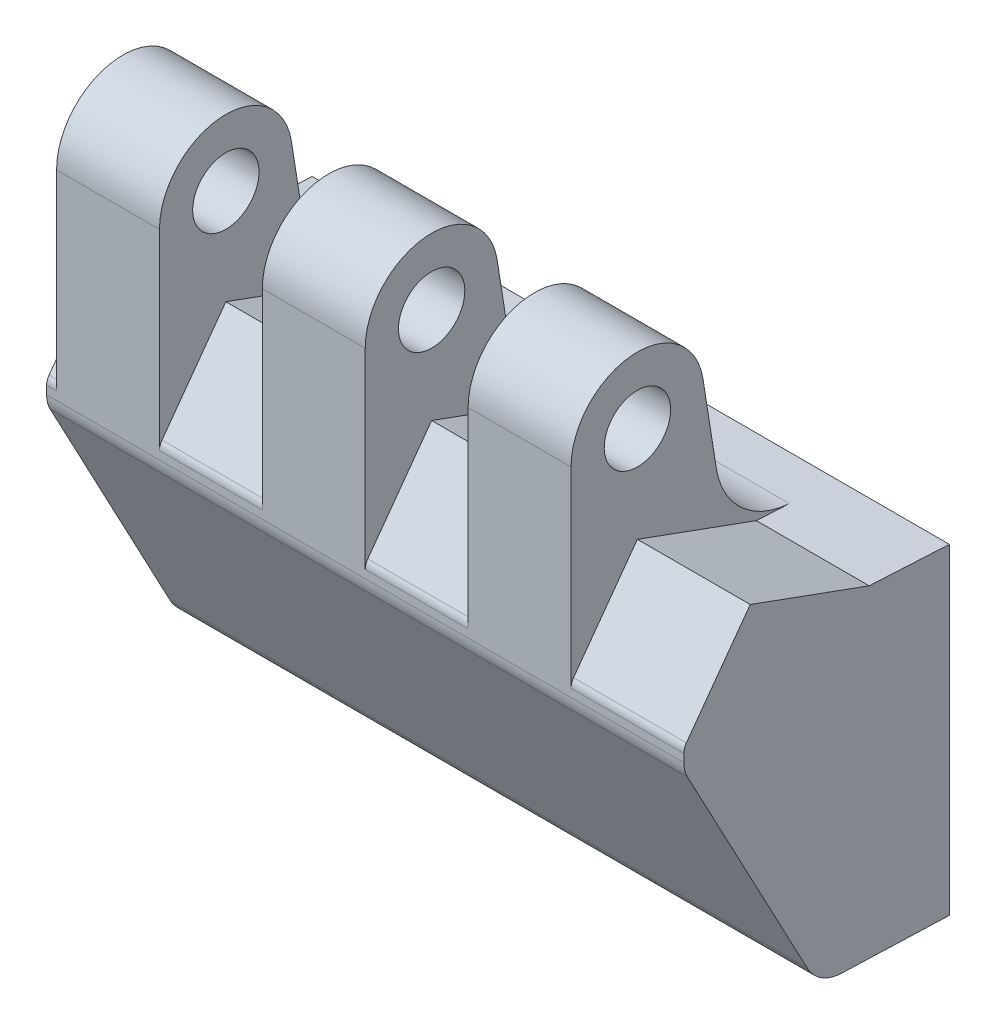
ISO-10303-21;
HEADER;
FILE_DESCRIPTION(('STEP AP214'),'2;1');
FILE_NAME('part.step','',(''),(''),'','','');
FILE_SCHEMA(('AUTOMOTIVE_DESIGN { 1 0 10303 214 1 1 1 1 }'));
ENDSEC;
DATA;
#1=APPLICATION_CONTEXT('core data for automotive mechanical design processes');
#2=APPLICATION_PROTOCOL_DEFINITION('international standard','automotive_design',2000,#1);
#3=PRODUCT_CONTEXT('',#1,'mechanical');
#4=PRODUCT('Part','Part','',(#3));
#5=PRODUCT_RELATED_PRODUCT_CATEGORY('part','',(#4));
#6=PRODUCT_DEFINITION_FORMATION('','',#4);
#7=PRODUCT_DEFINITION_CONTEXT('part definition',#1,'design');
#8=PRODUCT_DEFINITION('design','',#6,#7);
#9=PRODUCT_DEFINITION_SHAPE('','',#8);
#10=(LENGTH_UNIT() NAMED_UNIT(*) SI_UNIT(.MILLI.,.METRE.));
#11=(NAMED_UNIT(*) PLANE_ANGLE_UNIT() SI_UNIT($,.RADIAN.));
#12=(NAMED_UNIT(*) SI_UNIT($,.STERADIAN.) SOLID_ANGLE_UNIT());
#13=UNCERTAINTY_MEASURE_WITH_UNIT(LENGTH_MEASURE(1.E-05),#10,'distance_accuracy_value','');
#14=(GEOMETRIC_REPRESENTATION_CONTEXT(3) GLOBAL_UNCERTAINTY_ASSIGNED_CONTEXT((#13)) GLOBAL_UNIT_ASSIGNED_CONTEXT((#10,
#11,#12)) REPRESENTATION_CONTEXT('',''));
#15=CARTESIAN_POINT('',(0.,0.,0.));
#16=DIRECTION('',(0.,0.,1.));
#17=DIRECTION('',(1.,0.,0.));
#18=AXIS2_PLACEMENT_3D('',#15,#16,#17);
#19=CARTESIAN_POINT('',(-12.25,8.5711707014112,20.));
#20=DIRECTION('',(0.,0.,1.));
#21=DIRECTION('',(-1.,0.,0.));
#22=AXIS2_PLACEMENT_3D('',#19,#20,#21);
#23=PLANE('',#22);
#24=DIRECTION('',(-1.,0.,0.));
#25=VECTOR('',#24,1.);
#26=CARTESIAN_POINT('',(-12.25,8.5711707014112,20.));
#27=LINE('',#26,#25);
#28=CARTESIAN_POINT('',(-12.,8.5711707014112,20.));
#29=VERTEX_POINT('',#28);
#30=CARTESIAN_POINT('',(-11.25,8.5711707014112,20.));
#31=VERTEX_POINT('',#30);
#32=EDGE_CURVE('E347',#29,#31,#27,.F.);
#33=ORIENTED_EDGE('',*,*,#32,.F.);
#34=DIRECTION('',(0.,1.,0.));
#35=VECTOR('',#34,1.);
#36=CARTESIAN_POINT('',(-12.,7.9570784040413,20.));
#37=LINE('',#36,#35);
#38=CARTESIAN_POINT('',(-12.,7.9570784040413,20.));
#39=VERTEX_POINT('',#38);
#40=EDGE_CURVE('E30',#39,#29,#37,.T.);
#41=ORIENTED_EDGE('',*,*,#40,.F.);
#42=DIRECTION('',(-1.,0.,0.));
#43=VECTOR('',#42,1.);
#44=CARTESIAN_POINT('',(-12.25,7.9570784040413,20.));
#45=LINE('',#44,#43);
#46=CARTESIAN_POINT('',(36.,7.9570784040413,20.));
#47=VERTEX_POINT('',#46);
#48=EDGE_CURVE('E303',#39,#47,#45,.F.);
#49=ORIENTED_EDGE('',*,*,#48,.T.);
#50=DIRECTION('',(0.,-1.,0.));
#51=VECTOR('',#50,1.);
#52=CARTESIAN_POINT('',(36.,8.5711707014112,20.));
#53=LINE('',#52,#51);
#54=CARTESIAN_POINT('',(36.,8.5711707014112,20.));
#55=VERTEX_POINT('',#54);
#56=EDGE_CURVE('E650',#55,#47,#53,.T.);
#57=ORIENTED_EDGE('',*,*,#56,.F.);
#58=DIRECTION('',(-1.,0.,0.));
#59=VECTOR('',#58,1.);
#60=CARTESIAN_POINT('',(-12.25,8.5711707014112,20.));
#61=LINE('',#60,#59);
#62=CARTESIAN_POINT('',(27.5,8.5711707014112,20.));
#63=VERTEX_POINT('',#62);
#64=EDGE_CURVE('E336',#63,#55,#61,.F.);
#65=ORIENTED_EDGE('',*,*,#64,.F.);
#66=DIRECTION('',(0.,1.,0.));
#67=VECTOR('',#66,1.);
#68=CARTESIAN_POINT('',(27.5,23.,20.));
#69=LINE('',#68,#67);
#70=CARTESIAN_POINT('',(27.5,23.,20.));
#71=VERTEX_POINT('',#70);
#72=EDGE_CURVE('E399',#71,#63,#69,.F.);
#73=ORIENTED_EDGE('',*,*,#72,.F.);
#74=DIRECTION('',(-1.,0.,0.));
#75=VECTOR('',#74,1.);
#76=CARTESIAN_POINT('',(-12.25,23.,20.));
#77=LINE('',#76,#75);
#78=CARTESIAN_POINT('',(19.75,23.,20.));
#79=VERTEX_POINT('',#78);
#80=EDGE_CURVE('E333',#79,#71,#77,.F.);
#81=ORIENTED_EDGE('',*,*,#80,.F.);
#82=DIRECTION('',(0.,1.,0.));
#83=VECTOR('',#82,1.);
#84=CARTESIAN_POINT('',(19.75,23.,20.));
#85=LINE('',#84,#83);
#86=CARTESIAN_POINT('',(19.75,8.5711707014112,20.));
#87=VERTEX_POINT('',#86);
#88=EDGE_CURVE('E390',#79,#87,#85,.F.);
#89=ORIENTED_EDGE('',*,*,#88,.T.);
#90=DIRECTION('',(-1.,0.,0.));
#91=VECTOR('',#90,1.);
#92=CARTESIAN_POINT('',(-12.25,8.5711707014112,20.));
#93=LINE('',#92,#91);
#94=CARTESIAN_POINT('',(12.,8.5711707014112,20.));
#95=VERTEX_POINT('',#94);
#96=EDGE_CURVE('E308',#95,#87,#93,.F.);
#97=ORIENTED_EDGE('',*,*,#96,.F.);
#98=DIRECTION('',(0.,1.,0.));
#99=VECTOR('',#98,1.);
#100=CARTESIAN_POINT('',(12.,23.,20.));
#101=LINE('',#100,#99);
#102=CARTESIAN_POINT('',(12.,23.,20.));
#103=VERTEX_POINT('',#102);
#104=EDGE_CURVE('E379',#103,#95,#101,.F.);
#105=ORIENTED_EDGE('',*,*,#104,.F.);
#106=DIRECTION('',(-1.,0.,0.));
#107=VECTOR('',#106,1.);
#108=CARTESIAN_POINT('',(-12.25,23.,20.));
#109=LINE('',#108,#107);
#110=CARTESIAN_POINT('',(4.25,23.,20.));
#111=VERTEX_POINT('',#110);
#112=EDGE_CURVE('E305',#111,#103,#109,.F.);
#113=ORIENTED_EDGE('',*,*,#112,.F.);
#114=DIRECTION('',(0.,1.,0.));
#115=VECTOR('',#114,1.);
#116=CARTESIAN_POINT('',(4.25,23.,20.));
#117=LINE('',#116,#115);
#118=CARTESIAN_POINT('',(4.25,8.5711707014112,20.));
#119=VERTEX_POINT('',#118);
#120=EDGE_CURVE('E370',#111,#119,#117,.F.);
#121=ORIENTED_EDGE('',*,*,#120,.T.);
#122=DIRECTION('',(-1.,0.,0.));
#123=VECTOR('',#122,1.);
#124=CARTESIAN_POINT('',(-12.25,8.5711707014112,20.));
#125=LINE('',#124,#123);
#126=CARTESIAN_POINT('',(-3.5,8.5711707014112,20.));
#127=VERTEX_POINT('',#126);
#128=EDGE_CURVE('E309',#127,#119,#125,.F.);
#129=ORIENTED_EDGE('',*,*,#128,.F.);
#130=DIRECTION('',(0.,1.,0.));
#131=VECTOR('',#130,1.);
#132=CARTESIAN_POINT('',(-3.5,23.,20.));
#133=LINE('',#132,#131);
#134=CARTESIAN_POINT('',(-3.5,23.,20.));
#135=VERTEX_POINT('',#134);
#136=EDGE_CURVE('E417',#135,#127,#133,.F.);
#137=ORIENTED_EDGE('',*,*,#136,.F.);
#138=DIRECTION('',(-1.,0.,0.));
#139=VECTOR('',#138,1.);
#140=CARTESIAN_POINT('',(-12.25,23.,20.));
#141=LINE('',#140,#139);
#142=CARTESIAN_POINT('',(-11.25,23.,20.));
#143=VERTEX_POINT('',#142);
#144=EDGE_CURVE('E304',#143,#135,#141,.F.);
#145=ORIENTED_EDGE('',*,*,#144,.F.);
#146=DIRECTION('',(0.,1.,0.));
#147=VECTOR('',#146,1.);
#148=CARTESIAN_POINT('',(-11.25,23.,20.));
#149=LINE('',#148,#147);
#150=EDGE_CURVE('E405',#143,#31,#149,.F.);
#151=ORIENTED_EDGE('',*,*,#150,.T.);
#152=EDGE_LOOP('',(#33,#41,#49,#57,#65,#73,#81,#89,#97,#105,#113,#121,#129,#137,#145,#151));
#153=FACE_BOUND('',#152,.T.);
#154=ADVANCED_FACE('F14',(#153),#23,.T.);
#155=CARTESIAN_POINT('',(-12.25,7.9570784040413,17.75));
#156=DIRECTION('',(-1.,0.,0.));
#157=DIRECTION('',(0.,1.,0.));
#158=AXIS2_PLACEMENT_3D('',#155,#156,#157);
#159=CYLINDRICAL_SURFACE('',#158,2.25);
#160=ORIENTED_EDGE('',*,*,#48,.F.);
#161=CARTESIAN_POINT('',(-12.,7.9570784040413,17.75));
#162=DIRECTION('',(-1.,0.,0.));
#163=DIRECTION('',(0.,0.,1.));
#164=AXIS2_PLACEMENT_3D('',#161,#162,#163);
#165=CIRCLE('',#164,2.25000000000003);
#166=CARTESIAN_POINT('',(-12.,6.900767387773,19.7366320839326));
#167=VERTEX_POINT('',#166);
#168=EDGE_CURVE('E251',#167,#39,#165,.T.);
#169=ORIENTED_EDGE('',*,*,#168,.F.);
#170=DIRECTION('',(-1.,0.,0.));
#171=VECTOR('',#170,1.);
#172=CARTESIAN_POINT('',(-12.25,6.900767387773,19.7366320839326));
#173=LINE('',#172,#171);
#174=CARTESIAN_POINT('',(36.,6.90076738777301,19.7366320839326));
#175=VERTEX_POINT('',#174);
#176=EDGE_CURVE('E250',#167,#175,#173,.F.);
#177=ORIENTED_EDGE('',*,*,#176,.T.);
#178=CARTESIAN_POINT('',(36.,7.9570784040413,17.75));
#179=DIRECTION('',(1.,0.,0.));
#180=DIRECTION('',(0.,0.,-1.));
#181=AXIS2_PLACEMENT_3D('',#178,#179,#180);
#182=CIRCLE('',#181,2.25);
#183=EDGE_CURVE('E653',#47,#175,#182,.T.);
#184=ORIENTED_EDGE('',*,*,#183,.F.);
#185=EDGE_LOOP('',(#160,#169,#177,#184));
#186=FACE_BOUND('',#185,.T.);
#187=ADVANCED_FACE('F686',(#186),#159,.T.);
#188=CARTESIAN_POINT('',(-12.25,6.900767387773,19.7366320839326));
#189=DIRECTION('',(0.,-0.469471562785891,0.882947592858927));
#190=DIRECTION('',(0.,-0.882947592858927,-0.469471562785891));
#191=AXIS2_PLACEMENT_3D('',#188,#189,#190);
#192=PLANE('',#191);
#193=ORIENTED_EDGE('',*,*,#176,.F.);
#194=DIRECTION('',(0.,0.882947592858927,0.469471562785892));
#195=VECTOR('',#194,1.);
#196=CARTESIAN_POINT('',(-12.,-10.1260155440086,10.6833310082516));
#197=LINE('',#196,#195);
#198=CARTESIAN_POINT('',(-12.,-10.1260155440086,10.6833310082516));
#199=VERTEX_POINT('',#198);
#200=EDGE_CURVE('E237',#199,#167,#197,.T.);
#201=ORIENTED_EDGE('',*,*,#200,.F.);
#202=DIRECTION('',(-1.,0.,0.));
#203=VECTOR('',#202,1.);
#204=CARTESIAN_POINT('',(-12.25,-10.1260155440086,10.6833310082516));
#205=LINE('',#204,#203);
#206=CARTESIAN_POINT('',(36.,-10.1260155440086,10.6833310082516));
#207=VERTEX_POINT('',#206);
#208=EDGE_CURVE('E248',#199,#207,#205,.F.);
#209=ORIENTED_EDGE('',*,*,#208,.T.);
#210=DIRECTION('',(0.,-0.882947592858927,-0.469471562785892));
#211=VECTOR('',#210,1.);
#212=CARTESIAN_POINT('',(36.,6.90076738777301,19.7366320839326));
#213=LINE('',#212,#211);
#214=EDGE_CURVE('E656',#175,#207,#213,.T.);
#215=ORIENTED_EDGE('',*,*,#214,.F.);
#216=EDGE_LOOP('',(#193,#201,#209,#215));
#217=FACE_BOUND('',#216,.T.);
#218=ADVANCED_FACE('F246',(#217),#192,.T.);
#219=CARTESIAN_POINT('',(-12.25,-8.7176008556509,8.03448822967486));
#220=DIRECTION('',(-1.,0.,0.));
#221=DIRECTION('',(0.,1.,0.));
#222=AXIS2_PLACEMENT_3D('',#219,#220,#221);
#223=CYLINDRICAL_SURFACE('',#222,3.);
#224=ORIENTED_EDGE('',*,*,#208,.F.);
#225=CARTESIAN_POINT('',(-12.,-8.7176008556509,8.03448822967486));
#226=DIRECTION('',(-1.,0.,0.));
#227=DIRECTION('',(0.,0.,1.));
#228=AXIS2_PLACEMENT_3D('',#225,#226,#227);
#229=CIRCLE('',#228,3.);
#230=CARTESIAN_POINT('',(-12.,-11.7157733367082,8.13918671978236));
#231=VERTEX_POINT('',#230);
#232=EDGE_CURVE('E234',#231,#199,#229,.T.);
#233=ORIENTED_EDGE('',*,*,#232,.F.);
#234=DIRECTION('',(-1.,0.,0.));
#235=VECTOR('',#234,1.);
#236=CARTESIAN_POINT('',(-12.25,-11.7157733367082,8.13918671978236));
#237=LINE('',#236,#235);
#238=CARTESIAN_POINT('',(36.,-11.7157733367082,8.13918671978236));
#239=VERTEX_POINT('',#238);
#240=EDGE_CURVE('E438',#231,#239,#237,.F.);
#241=ORIENTED_EDGE('',*,*,#240,.T.);
#242=CARTESIAN_POINT('',(36.,-8.7176008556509,8.03448822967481));
#243=DIRECTION('',(1.,0.,0.));
#244=DIRECTION('',(0.,0.,-1.));
#245=AXIS2_PLACEMENT_3D('',#242,#243,#244);
#246=CIRCLE('',#245,3.);
#247=EDGE_CURVE('E256',#207,#239,#246,.T.);
#248=ORIENTED_EDGE('',*,*,#247,.F.);
#249=EDGE_LOOP('',(#224,#233,#241,#248));
#250=FACE_BOUND('',#249,.T.);
#251=ADVANCED_FACE('F254',(#250),#223,.T.);
#252=CARTESIAN_POINT('',(-12.25,12.2,0.));
#253=DIRECTION('',(0.,0.998629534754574,-0.0523359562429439));
#254=DIRECTION('',(0.,0.0523359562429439,0.998629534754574));
#255=AXIS2_PLACEMENT_3D('',#252,#253,#254);
#256=PLANE('',#255);
#257=DIRECTION('',(1.,0.,0.));
#258=VECTOR('',#257,1.);
#259=CARTESIAN_POINT('',(-12.25,12.2,0.));
#260=LINE('',#259,#258);
#261=CARTESIAN_POINT('',(36.,12.2,0.));
#262=VERTEX_POINT('',#261);
#263=CARTESIAN_POINT('',(-12.,12.2,0.));
#264=VERTEX_POINT('',#263);
#265=EDGE_CURVE('E23',#262,#264,#260,.F.);
#266=ORIENTED_EDGE('',*,*,#265,.T.);
#267=DIRECTION('',(0.,-0.0523359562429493,-0.998629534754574));
#268=VECTOR('',#267,1.);
#269=CARTESIAN_POINT('',(-12.,12.5164952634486,6.03908938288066));
#270=LINE('',#269,#268);
#271=CARTESIAN_POINT('',(-12.,12.5164952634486,6.03908938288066));
#272=VERTEX_POINT('',#271);
#273=EDGE_CURVE('E628',#272,#264,#270,.T.);
#274=ORIENTED_EDGE('',*,*,#273,.F.);
#275=DIRECTION('',(-1.,0.,0.));
#276=VECTOR('',#275,1.);
#277=CARTESIAN_POINT('',(-12.25,12.5164952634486,6.03908938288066));
#278=LINE('',#277,#276);
#279=CARTESIAN_POINT('',(-11.25,12.5164952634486,6.03908938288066));
#280=VERTEX_POINT('',#279);
#281=EDGE_CURVE('E271',#280,#272,#278,.T.);
#282=ORIENTED_EDGE('',*,*,#281,.F.);
#283=DIRECTION('',(0.,0.0523359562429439,0.998629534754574));
#284=VECTOR('',#283,1.);
#285=CARTESIAN_POINT('',(-11.25,12.2,0.));
#286=LINE('',#285,#284);
#287=CARTESIAN_POINT('',(-11.25,12.3862070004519,3.5530412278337));
#288=VERTEX_POINT('',#287);
#289=EDGE_CURVE('E526',#288,#280,#286,.T.);
#290=ORIENTED_EDGE('',*,*,#289,.F.);
#291=DIRECTION('',(-1.,0.,0.));
#292=VECTOR('',#291,1.);
#293=CARTESIAN_POINT('',(-12.25,12.3862070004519,3.5530412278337));
#294=LINE('',#293,#292);
#295=CARTESIAN_POINT('',(-3.5,12.3862070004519,3.5530412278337));
#296=VERTEX_POINT('',#295);
#297=EDGE_CURVE('E260',#296,#288,#294,.T.);
#298=ORIENTED_EDGE('',*,*,#297,.F.);
#299=DIRECTION('',(0.,0.0523359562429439,0.998629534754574));
#300=VECTOR('',#299,1.);
#301=CARTESIAN_POINT('',(-3.5,12.2,0.));
#302=LINE('',#301,#300);
#303=CARTESIAN_POINT('',(-3.5,12.5164952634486,6.03908938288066));
#304=VERTEX_POINT('',#303);
#305=EDGE_CURVE('E257',#304,#296,#302,.F.);
#306=ORIENTED_EDGE('',*,*,#305,.F.);
#307=DIRECTION('',(-1.,0.,0.));
#308=VECTOR('',#307,1.);
#309=CARTESIAN_POINT('',(-12.25,12.5164952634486,6.03908938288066));
#310=LINE('',#309,#308);
#311=CARTESIAN_POINT('',(4.25,12.5164952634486,6.03908938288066));
#312=VERTEX_POINT('',#311);
#313=EDGE_CURVE('E456',#312,#304,#310,.T.);
#314=ORIENTED_EDGE('',*,*,#313,.F.);
#315=DIRECTION('',(0.,0.0523359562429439,0.998629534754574));
#316=VECTOR('',#315,1.);
#317=CARTESIAN_POINT('',(4.25,12.2,0.));
#318=LINE('',#317,#316);
#319=CARTESIAN_POINT('',(4.25,12.3862070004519,3.5530412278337));
#320=VERTEX_POINT('',#319);
#321=EDGE_CURVE('E452',#320,#312,#318,.T.);
#322=ORIENTED_EDGE('',*,*,#321,.F.);
#323=DIRECTION('',(-1.,0.,0.));
#324=VECTOR('',#323,1.);
#325=CARTESIAN_POINT('',(-12.25,12.3862070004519,3.5530412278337));
#326=LINE('',#325,#324);
#327=CARTESIAN_POINT('',(12.,12.3862070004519,3.5530412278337));
#328=VERTEX_POINT('',#327);
#329=EDGE_CURVE('E449',#328,#320,#326,.T.);
#330=ORIENTED_EDGE('',*,*,#329,.F.);
#331=DIRECTION('',(0.,0.0523359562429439,0.998629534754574));
#332=VECTOR('',#331,1.);
#333=CARTESIAN_POINT('',(12.,12.2,0.));
#334=LINE('',#333,#332);
#335=CARTESIAN_POINT('',(12.,12.5164952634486,6.03908938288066));
#336=VERTEX_POINT('',#335);
#337=EDGE_CURVE('E453',#336,#328,#334,.F.);
#338=ORIENTED_EDGE('',*,*,#337,.F.);
#339=DIRECTION('',(-1.,0.,0.));
#340=VECTOR('',#339,1.);
#341=CARTESIAN_POINT('',(-12.25,12.5164952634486,6.03908938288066));
#342=LINE('',#341,#340);
#343=CARTESIAN_POINT('',(19.75,12.5164952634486,6.03908938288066));
#344=VERTEX_POINT('',#343);
#345=EDGE_CURVE('E467',#344,#336,#342,.T.);
#346=ORIENTED_EDGE('',*,*,#345,.F.);
#347=DIRECTION('',(0.,0.0523359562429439,0.998629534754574));
#348=VECTOR('',#347,1.);
#349=CARTESIAN_POINT('',(19.75,12.2,0.));
#350=LINE('',#349,#348);
#351=CARTESIAN_POINT('',(19.75,12.3862070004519,3.5530412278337));
#352=VERTEX_POINT('',#351);
#353=EDGE_CURVE('E484',#352,#344,#350,.T.);
#354=ORIENTED_EDGE('',*,*,#353,.F.);
#355=DIRECTION('',(-1.,0.,0.));
#356=VECTOR('',#355,1.);
#357=CARTESIAN_POINT('',(-12.25,12.3862070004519,3.5530412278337));
#358=LINE('',#357,#356);
#359=CARTESIAN_POINT('',(27.5,12.3862070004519,3.5530412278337));
#360=VERTEX_POINT('',#359);
#361=EDGE_CURVE('E492',#360,#352,#358,.T.);
#362=ORIENTED_EDGE('',*,*,#361,.F.);
#363=DIRECTION('',(0.,0.0523359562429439,0.998629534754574));
#364=VECTOR('',#363,1.);
#365=CARTESIAN_POINT('',(27.5,12.2,0.));
#366=LINE('',#365,#364);
#367=CARTESIAN_POINT('',(27.5,12.5164952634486,6.03908938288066));
#368=VERTEX_POINT('',#367);
#369=EDGE_CURVE('E504',#368,#360,#366,.F.);
#370=ORIENTED_EDGE('',*,*,#369,.F.);
#371=DIRECTION('',(-1.,0.,0.));
#372=VECTOR('',#371,1.);
#373=CARTESIAN_POINT('',(-12.25,12.5164952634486,6.03908938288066));
#374=LINE('',#373,#372);
#375=CARTESIAN_POINT('',(36.,12.5164952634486,6.03908938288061));
#376=VERTEX_POINT('',#375);
#377=EDGE_CURVE('E281',#376,#368,#374,.T.);
#378=ORIENTED_EDGE('',*,*,#377,.F.);
#379=DIRECTION('',(0.,0.0523359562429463,0.998629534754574));
#380=VECTOR('',#379,1.);
#381=CARTESIAN_POINT('',(36.,12.2,0.));
#382=LINE('',#381,#380);
#383=EDGE_CURVE('E643',#262,#376,#382,.T.);
#384=ORIENTED_EDGE('',*,*,#383,.F.);
#385=EDGE_LOOP('',(#266,#274,#282,#290,#298,#306,#314,#322,#330,#338,#346,#354,#362,#370,#378,#384));
#386=FACE_BOUND('',#385,.T.);
#387=ADVANCED_FACE('F557',(#386),#256,.T.);
#388=CARTESIAN_POINT('',(-12.25,-11.7157733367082,8.13918671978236));
#389=DIRECTION('',(0.,-0.999390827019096,0.0348994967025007));
#390=DIRECTION('',(0.,-0.0348994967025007,-0.999390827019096));
#391=AXIS2_PLACEMENT_3D('',#388,#389,#390);
#392=PLANE('',#391);
#393=ORIENTED_EDGE('',*,*,#240,.F.);
#394=DIRECTION('',(0.,0.0348994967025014,0.999390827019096));
#395=VECTOR('',#394,1.);
#396=CARTESIAN_POINT('',(-12.,-12.,0.));
#397=LINE('',#396,#395);
#398=CARTESIAN_POINT('',(-12.,-12.,0.));
#399=VERTEX_POINT('',#398);
#400=EDGE_CURVE('E239',#399,#231,#397,.T.);
#401=ORIENTED_EDGE('',*,*,#400,.F.);
#402=DIRECTION('',(1.,0.,0.));
#403=VECTOR('',#402,1.);
#404=CARTESIAN_POINT('',(-12.25,-12.,0.));
#405=LINE('',#404,#403);
#406=CARTESIAN_POINT('',(36.,-12.,0.));
#407=VERTEX_POINT('',#406);
#408=EDGE_CURVE('E9',#399,#407,#405,.T.);
#409=ORIENTED_EDGE('',*,*,#408,.T.);
#410=DIRECTION('',(0.,-0.0348994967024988,-0.999390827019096));
#411=VECTOR('',#410,1.);
#412=CARTESIAN_POINT('',(36.,-11.7157733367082,8.13918671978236));
#413=LINE('',#412,#411);
#414=EDGE_CURVE('E639',#239,#407,#413,.T.);
#415=ORIENTED_EDGE('',*,*,#414,.F.);
#416=EDGE_LOOP('',(#393,#401,#409,#415));
#417=FACE_BOUND('',#416,.T.);
#418=ADVANCED_FACE('F672',(#417),#392,.T.);
#419=CARTESIAN_POINT('',(-12.25,-12.,0.));
#420=DIRECTION('',(0.,0.,-1.));
#421=DIRECTION('',(1.,0.,0.));
#422=AXIS2_PLACEMENT_3D('',#419,#420,#421);
#423=PLANE('',#422);
#424=CARTESIAN_POINT('',(0.,0.,0.));
#425=DIRECTION('',(0.,0.,1.));
#426=DIRECTION('',(1.,0.,0.));
#427=AXIS2_PLACEMENT_3D('',#424,#425,#426);
#428=CIRCLE('',#427,2.5);
#429=CARTESIAN_POINT('',(2.5,0.,0.));
#430=VERTEX_POINT('',#429);
#431=EDGE_CURVE('E663',#430,#430,#428,.T.);
#432=ORIENTED_EDGE('',*,*,#431,.T.);
#433=EDGE_LOOP('',(#432));
#434=FACE_BOUND('',#433,.T.);
#435=CARTESIAN_POINT('',(24.,0.,0.));
#436=DIRECTION('',(0.,0.,1.));
#437=DIRECTION('',(1.,0.,0.));
#438=AXIS2_PLACEMENT_3D('',#435,#436,#437);
#439=CIRCLE('',#438,2.5);
#440=CARTESIAN_POINT('',(26.5,0.,0.));
#441=VERTEX_POINT('',#440);
#442=EDGE_CURVE('E659',#441,#441,#439,.T.);
#443=ORIENTED_EDGE('',*,*,#442,.T.);
#444=EDGE_LOOP('',(#443));
#445=FACE_BOUND('',#444,.T.);
#446=ORIENTED_EDGE('',*,*,#408,.F.);
#447=DIRECTION('',(0.,-1.,0.));
#448=VECTOR('',#447,1.);
#449=CARTESIAN_POINT('',(-12.,12.2,0.));
#450=LINE('',#449,#448);
#451=EDGE_CURVE('E631',#264,#399,#450,.T.);
#452=ORIENTED_EDGE('',*,*,#451,.F.);
#453=ORIENTED_EDGE('',*,*,#265,.F.);
#454=DIRECTION('',(0.,1.,0.));
#455=VECTOR('',#454,1.);
#456=CARTESIAN_POINT('',(36.,-12.,0.));
#457=LINE('',#456,#455);
#458=EDGE_CURVE('E641',#407,#262,#457,.T.);
#459=ORIENTED_EDGE('',*,*,#458,.F.);
#460=EDGE_LOOP('',(#446,#452,#453,#459));
#461=FACE_BOUND('',#460,.T.);
#462=ADVANCED_FACE('F674',(#434,#445,#461),#423,.T.);
#463=CARTESIAN_POINT('',(-12.25,12.5164952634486,6.03908938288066));
#464=DIRECTION('',(0.,0.939692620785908,-0.342020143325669));
#465=DIRECTION('',(0.,0.342020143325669,0.939692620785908));
#466=AXIS2_PLACEMENT_3D('',#463,#464,#465);
#467=PLANE('',#466);
#468=ORIENTED_EDGE('',*,*,#281,.T.);
#469=DIRECTION('',(0.,-0.342020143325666,-0.939692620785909));
#470=VECTOR('',#469,1.);
#471=CARTESIAN_POINT('',(-12.,15.778,15.));
#472=LINE('',#471,#470);
#473=CARTESIAN_POINT('',(-12.,15.778,15.));
#474=VERTEX_POINT('',#473);
#475=EDGE_CURVE('E625',#474,#272,#472,.T.);
#476=ORIENTED_EDGE('',*,*,#475,.F.);
#477=DIRECTION('',(-1.,0.,0.));
#478=VECTOR('',#477,1.);
#479=CARTESIAN_POINT('',(-12.25,15.778,15.));
#480=LINE('',#479,#478);
#481=CARTESIAN_POINT('',(-11.25,15.778,15.));
#482=VERTEX_POINT('',#481);
#483=EDGE_CURVE('E273',#474,#482,#480,.F.);
#484=ORIENTED_EDGE('',*,*,#483,.T.);
#485=DIRECTION('',(0.,0.342020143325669,0.939692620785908));
#486=VECTOR('',#485,1.);
#487=CARTESIAN_POINT('',(-11.25,12.5164952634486,6.03908938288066));
#488=LINE('',#487,#486);
#489=EDGE_CURVE('E291',#280,#482,#488,.T.);
#490=ORIENTED_EDGE('',*,*,#489,.F.);
#491=EDGE_LOOP('',(#468,#476,#484,#490));
#492=FACE_BOUND('',#491,.T.);
#493=ADVANCED_FACE('F624',(#492),#467,.T.);
#494=CARTESIAN_POINT('',(-12.25,15.778,15.));
#495=DIRECTION('',(0.,0.587785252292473,0.809016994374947));
#496=DIRECTION('',(0.,-0.809016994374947,0.587785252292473));
#497=AXIS2_PLACEMENT_3D('',#494,#495,#496);
#498=PLANE('',#497);
#499=ORIENTED_EDGE('',*,*,#483,.F.);
#500=DIRECTION('',(0.,0.809016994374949,-0.587785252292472));
#501=VECTOR('',#500,1.);
#502=CARTESIAN_POINT('',(-12.,9.15895595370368,19.809016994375));
#503=LINE('',#502,#501);
#504=CARTESIAN_POINT('',(-12.,9.15895595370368,19.809016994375));
#505=VERTEX_POINT('',#504);
#506=EDGE_CURVE('E634',#505,#474,#503,.T.);
#507=ORIENTED_EDGE('',*,*,#506,.F.);
#508=DIRECTION('',(-1.,0.,0.));
#509=VECTOR('',#508,1.);
#510=CARTESIAN_POINT('',(-12.25,9.1589559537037,19.8090169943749));
#511=LINE('',#510,#509);
#512=CARTESIAN_POINT('',(-11.25,9.1589559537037,19.809016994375));
#513=VERTEX_POINT('',#512);
#514=EDGE_CURVE('E262',#505,#513,#511,.F.);
#515=ORIENTED_EDGE('',*,*,#514,.T.);
#516=DIRECTION('',(0.,-0.809016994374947,0.587785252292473));
#517=VECTOR('',#516,1.);
#518=CARTESIAN_POINT('',(-11.25,15.778,15.));
#519=LINE('',#518,#517);
#520=EDGE_CURVE('E275',#482,#513,#519,.T.);
#521=ORIENTED_EDGE('',*,*,#520,.F.);
#522=EDGE_LOOP('',(#499,#507,#515,#521));
#523=FACE_BOUND('',#522,.T.);
#524=ADVANCED_FACE('F776',(#523),#498,.T.);
#525=CARTESIAN_POINT('',(-12.25,8.5711707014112,19.));
#526=DIRECTION('',(-1.,0.,0.));
#527=DIRECTION('',(0.,1.,0.));
#528=AXIS2_PLACEMENT_3D('',#525,#526,#527);
#529=CYLINDRICAL_SURFACE('',#528,1.);
#530=ORIENTED_EDGE('',*,*,#514,.F.);
#531=CARTESIAN_POINT('',(-12.,8.5711707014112,19.));
#532=DIRECTION('',(-1.,0.,0.));
#533=DIRECTION('',(0.,0.,1.));
#534=AXIS2_PLACEMENT_3D('',#531,#532,#533);
#535=CIRCLE('',#534,1.);
#536=EDGE_CURVE('E770',#29,#505,#535,.T.);
#537=ORIENTED_EDGE('',*,*,#536,.F.);
#538=ORIENTED_EDGE('',*,*,#32,.T.);
#539=CARTESIAN_POINT('',(-11.25,8.5711707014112,19.));
#540=DIRECTION('',(1.,0.,0.));
#541=DIRECTION('',(0.,1.,0.));
#542=AXIS2_PLACEMENT_3D('',#539,#540,#541);
#543=CIRCLE('',#542,1.);
#544=EDGE_CURVE('E268',#513,#31,#543,.T.);
#545=ORIENTED_EDGE('',*,*,#544,.F.);
#546=EDGE_LOOP('',(#530,#537,#538,#545));
#547=FACE_BOUND('',#546,.T.);
#548=ADVANCED_FACE('F732',(#547),#529,.T.);
#549=CARTESIAN_POINT('',(-12.25,8.5711707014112,19.));
#550=DIRECTION('',(-1.,0.,0.));
#551=DIRECTION('',(0.,1.,0.));
#552=AXIS2_PLACEMENT_3D('',#549,#550,#551);
#553=CYLINDRICAL_SURFACE('',#552,1.);
#554=ORIENTED_EDGE('',*,*,#64,.T.);
#555=CARTESIAN_POINT('',(36.,8.5711707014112,19.));
#556=DIRECTION('',(1.,0.,0.));
#557=DIRECTION('',(0.,0.,-1.));
#558=AXIS2_PLACEMENT_3D('',#555,#556,#557);
#559=CIRCLE('',#558,1.00000000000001);
#560=CARTESIAN_POINT('',(36.,9.1589559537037,19.809016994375));
#561=VERTEX_POINT('',#560);
#562=EDGE_CURVE('E648',#561,#55,#559,.T.);
#563=ORIENTED_EDGE('',*,*,#562,.F.);
#564=DIRECTION('',(-1.,0.,0.));
#565=VECTOR('',#564,1.);
#566=CARTESIAN_POINT('',(-12.25,9.15895595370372,19.809016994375));
#567=LINE('',#566,#565);
#568=CARTESIAN_POINT('',(27.5,9.1589559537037,19.809016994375));
#569=VERTEX_POINT('',#568);
#570=EDGE_CURVE('E287',#561,#569,#567,.T.);
#571=ORIENTED_EDGE('',*,*,#570,.T.);
#572=CARTESIAN_POINT('',(27.5,8.5711707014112,19.));
#573=DIRECTION('',(1.,0.,0.));
#574=DIRECTION('',(0.,1.,0.));
#575=AXIS2_PLACEMENT_3D('',#572,#573,#574);
#576=CIRCLE('',#575,1.);
#577=EDGE_CURVE('E353',#63,#569,#576,.F.);
#578=ORIENTED_EDGE('',*,*,#577,.F.);
#579=EDGE_LOOP('',(#554,#563,#571,#578));
#580=FACE_BOUND('',#579,.T.);
#581=ADVANCED_FACE('F728',(#580),#553,.T.);
#582=CARTESIAN_POINT('',(-12.25,15.778,15.));
#583=DIRECTION('',(0.,0.587785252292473,0.809016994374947));
#584=DIRECTION('',(0.,-0.809016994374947,0.587785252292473));
#585=AXIS2_PLACEMENT_3D('',#582,#583,#584);
#586=PLANE('',#585);
#587=ORIENTED_EDGE('',*,*,#570,.F.);
#588=DIRECTION('',(0.,-0.809016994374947,0.587785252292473));
#589=VECTOR('',#588,1.);
#590=CARTESIAN_POINT('',(36.,15.778,15.));
#591=LINE('',#590,#589);
#592=CARTESIAN_POINT('',(36.,15.778,15.));
#593=VERTEX_POINT('',#592);
#594=EDGE_CURVE('E646',#593,#561,#591,.T.);
#595=ORIENTED_EDGE('',*,*,#594,.F.);
#596=DIRECTION('',(-1.,0.,0.));
#597=VECTOR('',#596,1.);
#598=CARTESIAN_POINT('',(-12.25,15.778,15.));
#599=LINE('',#598,#597);
#600=CARTESIAN_POINT('',(27.5,15.778,15.));
#601=VERTEX_POINT('',#600);
#602=EDGE_CURVE('E276',#593,#601,#599,.T.);
#603=ORIENTED_EDGE('',*,*,#602,.T.);
#604=DIRECTION('',(0.,0.80901699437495,-0.58778525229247));
#605=VECTOR('',#604,1.);
#606=CARTESIAN_POINT('',(27.5,9.1589559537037,19.8090169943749));
#607=LINE('',#606,#605);
#608=EDGE_CURVE('E509',#569,#601,#607,.T.);
#609=ORIENTED_EDGE('',*,*,#608,.F.);
#610=EDGE_LOOP('',(#587,#595,#603,#609));
#611=FACE_BOUND('',#610,.T.);
#612=ADVANCED_FACE('F731',(#611),#586,.T.);
#613=CARTESIAN_POINT('',(-12.25,12.5164952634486,6.03908938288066));
#614=DIRECTION('',(0.,0.939692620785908,-0.342020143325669));
#615=DIRECTION('',(0.,0.342020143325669,0.939692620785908));
#616=AXIS2_PLACEMENT_3D('',#613,#614,#615);
#617=PLANE('',#616);
#618=ORIENTED_EDGE('',*,*,#602,.F.);
#619=DIRECTION('',(0.,0.342020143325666,0.939692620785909));
#620=VECTOR('',#619,1.);
#621=CARTESIAN_POINT('',(36.,12.5164952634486,6.03908938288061));
#622=LINE('',#621,#620);
#623=EDGE_CURVE('E618',#376,#593,#622,.T.);
#624=ORIENTED_EDGE('',*,*,#623,.F.);
#625=ORIENTED_EDGE('',*,*,#377,.T.);
#626=DIRECTION('',(0.,-0.342020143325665,-0.93969262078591));
#627=VECTOR('',#626,1.);
#628=CARTESIAN_POINT('',(27.5,15.778,15.));
#629=LINE('',#628,#627);
#630=EDGE_CURVE('E344',#601,#368,#629,.T.);
#631=ORIENTED_EDGE('',*,*,#630,.F.);
#632=EDGE_LOOP('',(#618,#624,#625,#631));
#633=FACE_BOUND('',#632,.T.);
#634=ADVANCED_FACE('F616',(#633),#617,.T.);
#635=CARTESIAN_POINT('',(-12.25,8.5711707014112,19.));
#636=DIRECTION('',(-1.,0.,0.));
#637=DIRECTION('',(0.,1.,0.));
#638=AXIS2_PLACEMENT_3D('',#635,#636,#637);
#639=CYLINDRICAL_SURFACE('',#638,1.);
#640=CARTESIAN_POINT('',(12.,8.5711707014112,19.));
#641=DIRECTION('',(1.,0.,0.));
#642=DIRECTION('',(0.,1.,0.));
#643=AXIS2_PLACEMENT_3D('',#640,#641,#642);
#644=CIRCLE('',#643,1.);
#645=CARTESIAN_POINT('',(12.,9.1589559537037,19.809016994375));
#646=VERTEX_POINT('',#645);
#647=EDGE_CURVE('E430',#95,#646,#644,.F.);
#648=ORIENTED_EDGE('',*,*,#647,.F.);
#649=ORIENTED_EDGE('',*,*,#96,.T.);
#650=CARTESIAN_POINT('',(19.75,8.5711707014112,19.));
#651=DIRECTION('',(1.,0.,0.));
#652=DIRECTION('',(0.,1.,0.));
#653=AXIS2_PLACEMENT_3D('',#650,#651,#652);
#654=CIRCLE('',#653,1.);
#655=CARTESIAN_POINT('',(19.75,9.1589559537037,19.809016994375));
#656=VERTEX_POINT('',#655);
#657=EDGE_CURVE('E433',#656,#87,#654,.T.);
#658=ORIENTED_EDGE('',*,*,#657,.F.);
#659=DIRECTION('',(-1.,0.,0.));
#660=VECTOR('',#659,1.);
#661=CARTESIAN_POINT('',(-12.25,9.15895595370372,19.809016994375));
#662=LINE('',#661,#660);
#663=EDGE_CURVE('E315',#656,#646,#662,.T.);
#664=ORIENTED_EDGE('',*,*,#663,.T.);
#665=EDGE_LOOP('',(#648,#649,#658,#664));
#666=FACE_BOUND('',#665,.T.);
#667=ADVANCED_FACE('F16',(#666),#639,.T.);
#668=CARTESIAN_POINT('',(-12.25,8.5711707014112,19.));
#669=DIRECTION('',(-1.,0.,0.));
#670=DIRECTION('',(0.,1.,0.));
#671=AXIS2_PLACEMENT_3D('',#668,#669,#670);
#672=CYLINDRICAL_SURFACE('',#671,1.);
#673=CARTESIAN_POINT('',(4.25,8.5711707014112,19.));
#674=DIRECTION('',(1.,0.,0.));
#675=DIRECTION('',(0.,1.,0.));
#676=AXIS2_PLACEMENT_3D('',#673,#674,#675);
#677=CIRCLE('',#676,1.);
#678=CARTESIAN_POINT('',(4.25,9.1589559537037,19.809016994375));
#679=VERTEX_POINT('',#678);
#680=EDGE_CURVE('E424',#679,#119,#677,.T.);
#681=ORIENTED_EDGE('',*,*,#680,.F.);
#682=DIRECTION('',(-1.,0.,0.));
#683=VECTOR('',#682,1.);
#684=CARTESIAN_POINT('',(-12.25,9.15895595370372,19.809016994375));
#685=LINE('',#684,#683);
#686=CARTESIAN_POINT('',(-3.5,9.1589559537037,19.809016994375));
#687=VERTEX_POINT('',#686);
#688=EDGE_CURVE('E300',#679,#687,#685,.T.);
#689=ORIENTED_EDGE('',*,*,#688,.T.);
#690=CARTESIAN_POINT('',(-3.5,8.5711707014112,19.));
#691=DIRECTION('',(1.,0.,0.));
#692=DIRECTION('',(0.,1.,0.));
#693=AXIS2_PLACEMENT_3D('',#690,#691,#692);
#694=CIRCLE('',#693,1.);
#695=EDGE_CURVE('E427',#127,#687,#694,.F.);
#696=ORIENTED_EDGE('',*,*,#695,.F.);
#697=ORIENTED_EDGE('',*,*,#128,.T.);
#698=EDGE_LOOP('',(#681,#689,#696,#697));
#699=FACE_BOUND('',#698,.T.);
#700=ADVANCED_FACE('F577',(#699),#672,.T.);
#701=CARTESIAN_POINT('',(-3.5,23.7821723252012,10.0615582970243));
#702=DIRECTION('',(0.,0.156434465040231,-0.987688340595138));
#703=DIRECTION('',(0.,0.987688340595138,0.156434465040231));
#704=AXIS2_PLACEMENT_3D('',#701,#702,#703);
#705=PLANE('',#704);
#706=DIRECTION('',(0.,0.987688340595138,0.156434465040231));
#707=VECTOR('',#706,1.);
#708=CARTESIAN_POINT('',(-3.5,17.4326512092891,9.05589294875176));
#709=LINE('',#708,#707);
#710=CARTESIAN_POINT('',(-3.5,17.4326512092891,9.05589294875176));
#711=VERTEX_POINT('',#710);
#712=CARTESIAN_POINT('',(-3.5,23.7821723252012,10.0615582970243));
#713=VERTEX_POINT('',#712);
#714=EDGE_CURVE('E418',#711,#713,#709,.T.);
#715=ORIENTED_EDGE('',*,*,#714,.F.);
#716=DIRECTION('',(1.,0.,0.));
#717=VECTOR('',#716,1.);
#718=CARTESIAN_POINT('',(-3.5,17.4326512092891,9.05589294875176));
#719=LINE('',#718,#717);
#720=CARTESIAN_POINT('',(-11.25,17.4326512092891,9.05589294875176));
#721=VERTEX_POINT('',#720);
#722=EDGE_CURVE('E354',#721,#711,#719,.T.);
#723=ORIENTED_EDGE('',*,*,#722,.F.);
#724=DIRECTION('',(0.,0.987688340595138,0.156434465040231));
#725=VECTOR('',#724,1.);
#726=CARTESIAN_POINT('',(-11.25,17.4326512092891,9.05589294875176));
#727=LINE('',#726,#725);
#728=CARTESIAN_POINT('',(-11.25,23.7821723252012,10.0615582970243));
#729=VERTEX_POINT('',#728);
#730=EDGE_CURVE('E409',#721,#729,#727,.T.);
#731=ORIENTED_EDGE('',*,*,#730,.T.);
#732=DIRECTION('',(1.,0.,0.));
#733=VECTOR('',#732,1.);
#734=CARTESIAN_POINT('',(-3.5,23.7821723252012,10.0615582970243));
#735=LINE('',#734,#733);
#736=EDGE_CURVE('E339',#729,#713,#735,.T.);
#737=ORIENTED_EDGE('',*,*,#736,.T.);
#738=EDGE_LOOP('',(#715,#723,#731,#737));
#739=FACE_BOUND('',#738,.T.);
#740=ADVANCED_FACE('F564',(#739),#705,.T.);
#741=CARTESIAN_POINT('',(-3.5,23.,15.));
#742=DIRECTION('',(1.,0.,0.));
#743=DIRECTION('',(0.,-1.,0.));
#744=AXIS2_PLACEMENT_3D('',#741,#742,#743);
#745=CYLINDRICAL_SURFACE('',#744,5.);
#746=CARTESIAN_POINT('',(-3.5,23.,15.));
#747=DIRECTION('',(-1.,0.,0.));
#748=DIRECTION('',(0.,-1.,0.));
#749=AXIS2_PLACEMENT_3D('',#746,#747,#748);
#750=CIRCLE('',#749,5.);
#751=EDGE_CURVE('E414',#713,#135,#750,.F.);
#752=ORIENTED_EDGE('',*,*,#751,.F.);
#753=ORIENTED_EDGE('',*,*,#736,.F.);
#754=CARTESIAN_POINT('',(-11.25,23.,15.));
#755=DIRECTION('',(-1.,0.,0.));
#756=DIRECTION('',(0.,-1.,0.));
#757=AXIS2_PLACEMENT_3D('',#754,#755,#756);
#758=CIRCLE('',#757,5.);
#759=EDGE_CURVE('E406',#729,#143,#758,.F.);
#760=ORIENTED_EDGE('',*,*,#759,.T.);
#761=ORIENTED_EDGE('',*,*,#144,.T.);
#762=EDGE_LOOP('',(#752,#753,#760,#761));
#763=FACE_BOUND('',#762,.T.);
#764=ADVANCED_FACE('F568',(#763),#745,.T.);
#765=CARTESIAN_POINT('',(-3.5,23.,15.));
#766=DIRECTION('',(1.,0.,0.));
#767=DIRECTION('',(0.,-1.,0.));
#768=AXIS2_PLACEMENT_3D('',#765,#766,#767);
#769=CYLINDRICAL_SURFACE('',#768,2.5);
#770=CARTESIAN_POINT('',(-3.5,23.,15.));
#771=DIRECTION('',(-1.,0.,0.));
#772=DIRECTION('',(0.,-1.,0.));
#773=AXIS2_PLACEMENT_3D('',#770,#771,#772);
#774=CIRCLE('',#773,2.5);
#775=CARTESIAN_POINT('',(-3.5,20.5,15.));
#776=VERTEX_POINT('',#775);
#777=EDGE_CURVE('E419',#776,#776,#774,.T.);
#778=ORIENTED_EDGE('',*,*,#777,.F.);
#779=EDGE_LOOP('',(#778));
#780=FACE_BOUND('',#779,.T.);
#781=CARTESIAN_POINT('',(-11.25,23.,15.));
#782=DIRECTION('',(-1.,0.,0.));
#783=DIRECTION('',(0.,-1.,0.));
#784=AXIS2_PLACEMENT_3D('',#781,#782,#783);
#785=CIRCLE('',#784,2.5);
#786=CARTESIAN_POINT('',(-11.25,20.5,15.));
#787=VERTEX_POINT('',#786);
#788=EDGE_CURVE('E280',#787,#787,#785,.T.);
#789=ORIENTED_EDGE('',*,*,#788,.T.);
#790=EDGE_LOOP('',(#789));
#791=FACE_BOUND('',#790,.T.);
#792=ADVANCED_FACE('F719',(#780,#791),#769,.F.);
#793=CARTESIAN_POINT('',(19.75,17.4326512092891,9.05589294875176));
#794=DIRECTION('',(0.,0.156434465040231,-0.987688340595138));
#795=DIRECTION('',(0.,0.987688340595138,0.156434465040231));
#796=AXIS2_PLACEMENT_3D('',#793,#794,#795);
#797=PLANE('',#796);
#798=DIRECTION('',(0.,0.987688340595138,0.156434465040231));
#799=VECTOR('',#798,1.);
#800=CARTESIAN_POINT('',(19.75,17.4326512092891,9.05589294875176));
#801=LINE('',#800,#799);
#802=CARTESIAN_POINT('',(19.75,17.4326512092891,9.05589294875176));
#803=VERTEX_POINT('',#802);
#804=CARTESIAN_POINT('',(19.75,23.7821723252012,10.0615582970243));
#805=VERTEX_POINT('',#804);
#806=EDGE_CURVE('E391',#803,#805,#801,.T.);
#807=ORIENTED_EDGE('',*,*,#806,.T.);
#808=DIRECTION('',(-1.,0.,0.));
#809=VECTOR('',#808,1.);
#810=CARTESIAN_POINT('',(19.75,23.7821723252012,10.0615582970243));
#811=LINE('',#810,#809);
#812=CARTESIAN_POINT('',(27.5,23.7821723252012,10.0615582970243));
#813=VERTEX_POINT('',#812);
#814=EDGE_CURVE('E330',#805,#813,#811,.F.);
#815=ORIENTED_EDGE('',*,*,#814,.T.);
#816=DIRECTION('',(0.,0.987688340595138,0.156434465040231));
#817=VECTOR('',#816,1.);
#818=CARTESIAN_POINT('',(27.5,17.4326512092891,9.05589294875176));
#819=LINE('',#818,#817);
#820=CARTESIAN_POINT('',(27.5,17.4326512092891,9.05589294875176));
#821=VERTEX_POINT('',#820);
#822=EDGE_CURVE('E400',#821,#813,#819,.T.);
#823=ORIENTED_EDGE('',*,*,#822,.F.);
#824=DIRECTION('',(-1.,0.,0.));
#825=VECTOR('',#824,1.);
#826=CARTESIAN_POINT('',(19.75,17.4326512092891,9.05589294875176));
#827=LINE('',#826,#825);
#828=EDGE_CURVE('E340',#803,#821,#827,.F.);
#829=ORIENTED_EDGE('',*,*,#828,.F.);
#830=EDGE_LOOP('',(#807,#815,#823,#829));
#831=FACE_BOUND('',#830,.T.);
#832=ADVANCED_FACE('F715',(#831),#797,.T.);
#833=CARTESIAN_POINT('',(19.75,23.,15.));
#834=DIRECTION('',(-1.,0.,0.));
#835=DIRECTION('',(0.,1.,0.));
#836=AXIS2_PLACEMENT_3D('',#833,#834,#835);
#837=CYLINDRICAL_SURFACE('',#836,5.);
#838=CARTESIAN_POINT('',(19.75,23.,15.));
#839=DIRECTION('',(1.,0.,0.));
#840=DIRECTION('',(0.,1.,0.));
#841=AXIS2_PLACEMENT_3D('',#838,#839,#840);
#842=CIRCLE('',#841,5.);
#843=EDGE_CURVE('E387',#805,#79,#842,.T.);
#844=ORIENTED_EDGE('',*,*,#843,.T.);
#845=ORIENTED_EDGE('',*,*,#80,.T.);
#846=CARTESIAN_POINT('',(27.5,23.,15.));
#847=DIRECTION('',(1.,0.,0.));
#848=DIRECTION('',(0.,1.,0.));
#849=AXIS2_PLACEMENT_3D('',#846,#847,#848);
#850=CIRCLE('',#849,5.);
#851=EDGE_CURVE('E396',#813,#71,#850,.T.);
#852=ORIENTED_EDGE('',*,*,#851,.F.);
#853=ORIENTED_EDGE('',*,*,#814,.F.);
#854=EDGE_LOOP('',(#844,#845,#852,#853));
#855=FACE_BOUND('',#854,.T.);
#856=ADVANCED_FACE('F711',(#855),#837,.T.);
#857=CARTESIAN_POINT('',(19.75,23.,15.));
#858=DIRECTION('',(-1.,0.,0.));
#859=DIRECTION('',(0.,1.,0.));
#860=AXIS2_PLACEMENT_3D('',#857,#858,#859);
#861=CYLINDRICAL_SURFACE('',#860,2.5);
#862=CARTESIAN_POINT('',(27.5,23.,15.));
#863=DIRECTION('',(1.,0.,0.));
#864=DIRECTION('',(0.,1.,0.));
#865=AXIS2_PLACEMENT_3D('',#862,#863,#864);
#866=CIRCLE('',#865,2.5);
#867=CARTESIAN_POINT('',(27.5,25.5,15.));
#868=VERTEX_POINT('',#867);
#869=EDGE_CURVE('E279',#868,#868,#866,.F.);
#870=ORIENTED_EDGE('',*,*,#869,.F.);
#871=EDGE_LOOP('',(#870));
#872=FACE_BOUND('',#871,.T.);
#873=CARTESIAN_POINT('',(19.75,23.,15.));
#874=DIRECTION('',(1.,0.,0.));
#875=DIRECTION('',(0.,1.,0.));
#876=AXIS2_PLACEMENT_3D('',#873,#874,#875);
#877=CIRCLE('',#876,2.5);
#878=CARTESIAN_POINT('',(19.75,25.5,15.));
#879=VERTEX_POINT('',#878);
#880=EDGE_CURVE('E383',#879,#879,#877,.F.);
#881=ORIENTED_EDGE('',*,*,#880,.T.);
#882=EDGE_LOOP('',(#881));
#883=FACE_BOUND('',#882,.T.);
#884=ADVANCED_FACE('F708',(#872,#883),#861,.F.);
#885=CARTESIAN_POINT('',(-12.25,15.778,15.));
#886=DIRECTION('',(0.,0.587785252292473,0.809016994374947));
#887=DIRECTION('',(0.,-0.809016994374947,0.587785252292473));
#888=AXIS2_PLACEMENT_3D('',#885,#886,#887);
#889=PLANE('',#888);
#890=DIRECTION('',(0.,0.80901699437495,-0.58778525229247));
#891=VECTOR('',#890,1.);
#892=CARTESIAN_POINT('',(12.,9.1589559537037,19.8090169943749));
#893=LINE('',#892,#891);
#894=CARTESIAN_POINT('',(12.,15.778,15.));
#895=VERTEX_POINT('',#894);
#896=EDGE_CURVE('E470',#646,#895,#893,.T.);
#897=ORIENTED_EDGE('',*,*,#896,.F.);
#898=ORIENTED_EDGE('',*,*,#663,.F.);
#899=DIRECTION('',(0.,0.80901699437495,-0.58778525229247));
#900=VECTOR('',#899,1.);
#901=CARTESIAN_POINT('',(19.75,9.1589559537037,19.8090169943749));
#902=LINE('',#901,#900);
#903=CARTESIAN_POINT('',(19.75,15.778,15.));
#904=VERTEX_POINT('',#903);
#905=EDGE_CURVE('E386',#656,#904,#902,.T.);
#906=ORIENTED_EDGE('',*,*,#905,.T.);
#907=DIRECTION('',(-1.,0.,0.));
#908=VECTOR('',#907,1.);
#909=CARTESIAN_POINT('',(-12.25,15.778,15.));
#910=LINE('',#909,#908);
#911=EDGE_CURVE('E321',#904,#895,#910,.T.);
#912=ORIENTED_EDGE('',*,*,#911,.T.);
#913=EDGE_LOOP('',(#897,#898,#906,#912));
#914=FACE_BOUND('',#913,.T.);
#915=ADVANCED_FACE('F596',(#914),#889,.T.);
#916=CARTESIAN_POINT('',(12.,23.7821723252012,10.0615582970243));
#917=DIRECTION('',(0.,0.156434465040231,-0.987688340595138));
#918=DIRECTION('',(0.,0.987688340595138,0.156434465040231));
#919=AXIS2_PLACEMENT_3D('',#916,#917,#918);
#920=PLANE('',#919);
#921=DIRECTION('',(0.,0.987688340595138,0.156434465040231));
#922=VECTOR('',#921,1.);
#923=CARTESIAN_POINT('',(12.,17.4326512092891,9.05589294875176));
#924=LINE('',#923,#922);
#925=CARTESIAN_POINT('',(12.,17.4326512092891,9.05589294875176));
#926=VERTEX_POINT('',#925);
#927=CARTESIAN_POINT('',(12.,23.7821723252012,10.0615582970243));
#928=VERTEX_POINT('',#927);
#929=EDGE_CURVE('E380',#926,#928,#924,.T.);
#930=ORIENTED_EDGE('',*,*,#929,.F.);
#931=DIRECTION('',(1.,0.,0.));
#932=VECTOR('',#931,1.);
#933=CARTESIAN_POINT('',(12.,17.4326512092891,9.05589294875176));
#934=LINE('',#933,#932);
#935=CARTESIAN_POINT('',(4.25,17.4326512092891,9.05589294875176));
#936=VERTEX_POINT('',#935);
#937=EDGE_CURVE('E316',#936,#926,#934,.T.);
#938=ORIENTED_EDGE('',*,*,#937,.F.);
#939=DIRECTION('',(0.,0.987688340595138,0.156434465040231));
#940=VECTOR('',#939,1.);
#941=CARTESIAN_POINT('',(4.25,17.4326512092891,9.05589294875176));
#942=LINE('',#941,#940);
#943=CARTESIAN_POINT('',(4.25,23.7821723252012,10.0615582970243));
#944=VERTEX_POINT('',#943);
#945=EDGE_CURVE('E371',#936,#944,#942,.T.);
#946=ORIENTED_EDGE('',*,*,#945,.T.);
#947=DIRECTION('',(1.,0.,0.));
#948=VECTOR('',#947,1.);
#949=CARTESIAN_POINT('',(12.,23.7821723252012,10.0615582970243));
#950=LINE('',#949,#948);
#951=EDGE_CURVE('E312',#944,#928,#950,.T.);
#952=ORIENTED_EDGE('',*,*,#951,.T.);
#953=EDGE_LOOP('',(#930,#938,#946,#952));
#954=FACE_BOUND('',#953,.T.);
#955=ADVANCED_FACE('F701',(#954),#920,.T.);
#956=CARTESIAN_POINT('',(12.,23.,15.));
#957=DIRECTION('',(1.,0.,0.));
#958=DIRECTION('',(0.,-1.,0.));
#959=AXIS2_PLACEMENT_3D('',#956,#957,#958);
#960=CYLINDRICAL_SURFACE('',#959,5.);
#961=CARTESIAN_POINT('',(12.,23.,15.));
#962=DIRECTION('',(-1.,0.,0.));
#963=DIRECTION('',(0.,-1.,0.));
#964=AXIS2_PLACEMENT_3D('',#961,#962,#963);
#965=CIRCLE('',#964,5.);
#966=EDGE_CURVE('E376',#928,#103,#965,.F.);
#967=ORIENTED_EDGE('',*,*,#966,.F.);
#968=ORIENTED_EDGE('',*,*,#951,.F.);
#969=CARTESIAN_POINT('',(4.25,23.,15.));
#970=DIRECTION('',(-1.,0.,0.));
#971=DIRECTION('',(0.,-1.,0.));
#972=AXIS2_PLACEMENT_3D('',#969,#970,#971);
#973=CIRCLE('',#972,5.);
#974=EDGE_CURVE('E367',#944,#111,#973,.F.);
#975=ORIENTED_EDGE('',*,*,#974,.T.);
#976=ORIENTED_EDGE('',*,*,#112,.T.);
#977=EDGE_LOOP('',(#967,#968,#975,#976));
#978=FACE_BOUND('',#977,.T.);
#979=ADVANCED_FACE('F698',(#978),#960,.T.);
#980=CARTESIAN_POINT('',(12.,23.,15.));
#981=DIRECTION('',(1.,0.,0.));
#982=DIRECTION('',(0.,-1.,0.));
#983=AXIS2_PLACEMENT_3D('',#980,#981,#982);
#984=CYLINDRICAL_SURFACE('',#983,2.5);
#985=CARTESIAN_POINT('',(12.,23.,15.));
#986=DIRECTION('',(-1.,0.,0.));
#987=DIRECTION('',(0.,-1.,0.));
#988=AXIS2_PLACEMENT_3D('',#985,#986,#987);
#989=CIRCLE('',#988,2.5);
#990=CARTESIAN_POINT('',(12.,20.5,15.));
#991=VERTEX_POINT('',#990);
#992=EDGE_CURVE('E324',#991,#991,#989,.T.);
#993=ORIENTED_EDGE('',*,*,#992,.F.);
#994=EDGE_LOOP('',(#993));
#995=FACE_BOUND('',#994,.T.);
#996=CARTESIAN_POINT('',(4.25,23.,15.));
#997=DIRECTION('',(-1.,0.,0.));
#998=DIRECTION('',(0.,-1.,0.));
#999=AXIS2_PLACEMENT_3D('',#996,#997,#998);
#1000=CIRCLE('',#999,2.5);
#1001=CARTESIAN_POINT('',(4.25,20.5,15.));
#1002=VERTEX_POINT('',#1001);
#1003=EDGE_CURVE('E362',#1002,#1002,#1000,.T.);
#1004=ORIENTED_EDGE('',*,*,#1003,.T.);
#1005=EDGE_LOOP('',(#1004));
#1006=FACE_BOUND('',#1005,.T.);
#1007=ADVANCED_FACE('F696',(#995,#1006),#984,.F.);
#1008=CARTESIAN_POINT('',(-12.25,15.778,15.));
#1009=DIRECTION('',(0.,0.587785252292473,0.809016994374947));
#1010=DIRECTION('',(0.,-0.809016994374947,0.587785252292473));
#1011=AXIS2_PLACEMENT_3D('',#1008,#1009,#1010);
#1012=PLANE('',#1011);
#1013=DIRECTION('',(0.,0.80901699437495,-0.58778525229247));
#1014=VECTOR('',#1013,1.);
#1015=CARTESIAN_POINT('',(4.25,9.1589559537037,19.8090169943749));
#1016=LINE('',#1015,#1014);
#1017=CARTESIAN_POINT('',(4.25,15.778,15.));
#1018=VERTEX_POINT('',#1017);
#1019=EDGE_CURVE('E366',#679,#1018,#1016,.T.);
#1020=ORIENTED_EDGE('',*,*,#1019,.T.);
#1021=DIRECTION('',(-1.,0.,0.));
#1022=VECTOR('',#1021,1.);
#1023=CARTESIAN_POINT('',(-12.25,15.778,15.));
#1024=LINE('',#1023,#1022);
#1025=CARTESIAN_POINT('',(-3.5,15.778,15.));
#1026=VERTEX_POINT('',#1025);
#1027=EDGE_CURVE('E294',#1018,#1026,#1024,.T.);
#1028=ORIENTED_EDGE('',*,*,#1027,.T.);
#1029=DIRECTION('',(0.,0.80901699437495,-0.58778525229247));
#1030=VECTOR('',#1029,1.);
#1031=CARTESIAN_POINT('',(-3.5,9.1589559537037,19.8090169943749));
#1032=LINE('',#1031,#1030);
#1033=EDGE_CURVE('E358',#687,#1026,#1032,.T.);
#1034=ORIENTED_EDGE('',*,*,#1033,.F.);
#1035=ORIENTED_EDGE('',*,*,#688,.F.);
#1036=EDGE_LOOP('',(#1020,#1028,#1034,#1035));
#1037=FACE_BOUND('',#1036,.T.);
#1038=ADVANCED_FACE('F579',(#1037),#1012,.T.);
#1039=CARTESIAN_POINT('',(-3.5,23.,0.));
#1040=DIRECTION('',(-1.,0.,0.));
#1041=DIRECTION('',(0.,1.,0.));
#1042=AXIS2_PLACEMENT_3D('',#1039,#1040,#1041);
#1043=PLANE('',#1042);
#1044=DIRECTION('',(0.,0.342020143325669,0.939692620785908));
#1045=VECTOR('',#1044,1.);
#1046=CARTESIAN_POINT('',(-3.5,12.5164952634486,6.03908938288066));
#1047=LINE('',#1046,#1045);
#1048=EDGE_CURVE('E365',#1026,#304,#1047,.F.);
#1049=ORIENTED_EDGE('',*,*,#1048,.T.);
#1050=ORIENTED_EDGE('',*,*,#305,.T.);
#1051=CARTESIAN_POINT('',(-3.5,18.3712579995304,3.12976290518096));
#1052=DIRECTION('',(-1.,0.,0.));
#1053=DIRECTION('',(0.,-1.,0.));
#1054=AXIS2_PLACEMENT_3D('',#1051,#1052,#1053);
#1055=CIRCLE('',#1054,6.);
#1056=EDGE_CURVE('E357',#711,#296,#1055,.F.);
#1057=ORIENTED_EDGE('',*,*,#1056,.F.);
#1058=ORIENTED_EDGE('',*,*,#714,.T.);
#1059=ORIENTED_EDGE('',*,*,#751,.T.);
#1060=ORIENTED_EDGE('',*,*,#136,.T.);
#1061=ORIENTED_EDGE('',*,*,#695,.T.);
#1062=ORIENTED_EDGE('',*,*,#1033,.T.);
#1063=EDGE_LOOP('',(#1049,#1050,#1057,#1058,#1059,#1060,#1061,#1062));
#1064=FACE_BOUND('',#1063,.T.);
#1065=ORIENTED_EDGE('',*,*,#777,.T.);
#1066=EDGE_LOOP('',(#1065));
#1067=FACE_BOUND('',#1066,.T.);
#1068=ADVANCED_FACE('F549',(#1064,#1067),#1043,.F.);
#1069=CARTESIAN_POINT('',(-3.5,18.3712579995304,3.12976290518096));
#1070=DIRECTION('',(1.,0.,0.));
#1071=DIRECTION('',(0.,-1.,0.));
#1072=AXIS2_PLACEMENT_3D('',#1069,#1070,#1071);
#1073=CYLINDRICAL_SURFACE('',#1072,6.);
#1074=ORIENTED_EDGE('',*,*,#1056,.T.);
#1075=ORIENTED_EDGE('',*,*,#297,.T.);
#1076=CARTESIAN_POINT('',(-11.25,18.3712579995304,3.12976290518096));
#1077=DIRECTION('',(-1.,0.,0.));
#1078=DIRECTION('',(0.,-1.,0.));
#1079=AXIS2_PLACEMENT_3D('',#1076,#1077,#1078);
#1080=CIRCLE('',#1079,6.);
#1081=EDGE_CURVE('E410',#288,#721,#1080,.T.);
#1082=ORIENTED_EDGE('',*,*,#1081,.T.);
#1083=ORIENTED_EDGE('',*,*,#722,.T.);
#1084=EDGE_LOOP('',(#1074,#1075,#1082,#1083));
#1085=FACE_BOUND('',#1084,.T.);
#1086=ADVANCED_FACE('F560',(#1085),#1073,.F.);
#1087=CARTESIAN_POINT('',(-11.25,23.,0.));
#1088=DIRECTION('',(-1.,0.,0.));
#1089=DIRECTION('',(0.,1.,0.));
#1090=AXIS2_PLACEMENT_3D('',#1087,#1088,#1089);
#1091=PLANE('',#1090);
#1092=ORIENTED_EDGE('',*,*,#788,.F.);
#1093=EDGE_LOOP('',(#1092));
#1094=FACE_BOUND('',#1093,.T.);
#1095=ORIENTED_EDGE('',*,*,#520,.T.);
#1096=ORIENTED_EDGE('',*,*,#544,.T.);
#1097=ORIENTED_EDGE('',*,*,#150,.F.);
#1098=ORIENTED_EDGE('',*,*,#759,.F.);
#1099=ORIENTED_EDGE('',*,*,#730,.F.);
#1100=ORIENTED_EDGE('',*,*,#1081,.F.);
#1101=ORIENTED_EDGE('',*,*,#289,.T.);
#1102=ORIENTED_EDGE('',*,*,#489,.T.);
#1103=EDGE_LOOP('',(#1095,#1096,#1097,#1098,#1099,#1100,#1101,#1102));
#1104=FACE_BOUND('',#1103,.T.);
#1105=ADVANCED_FACE('F781',(#1094,#1104),#1091,.T.);
#1106=CARTESIAN_POINT('',(27.5,23.,0.));
#1107=DIRECTION('',(-1.,0.,0.));
#1108=DIRECTION('',(0.,1.,0.));
#1109=AXIS2_PLACEMENT_3D('',#1106,#1107,#1108);
#1110=PLANE('',#1109);
#1111=ORIENTED_EDGE('',*,*,#630,.T.);
#1112=ORIENTED_EDGE('',*,*,#369,.T.);
#1113=CARTESIAN_POINT('',(27.5,18.3712579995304,3.12976290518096));
#1114=DIRECTION('',(1.,0.,0.));
#1115=DIRECTION('',(0.,1.,0.));
#1116=AXIS2_PLACEMENT_3D('',#1113,#1114,#1115);
#1117=CIRCLE('',#1116,6.);
#1118=EDGE_CURVE('E343',#821,#360,#1117,.T.);
#1119=ORIENTED_EDGE('',*,*,#1118,.F.);
#1120=ORIENTED_EDGE('',*,*,#822,.T.);
#1121=ORIENTED_EDGE('',*,*,#851,.T.);
#1122=ORIENTED_EDGE('',*,*,#72,.T.);
#1123=ORIENTED_EDGE('',*,*,#577,.T.);
#1124=ORIENTED_EDGE('',*,*,#608,.T.);
#1125=EDGE_LOOP('',(#1111,#1112,#1119,#1120,#1121,#1122,#1123,#1124));
#1126=FACE_BOUND('',#1125,.T.);
#1127=ORIENTED_EDGE('',*,*,#869,.T.);
#1128=EDGE_LOOP('',(#1127));
#1129=FACE_BOUND('',#1128,.T.);
#1130=ADVANCED_FACE('F610',(#1126,#1129),#1110,.F.);
#1131=CARTESIAN_POINT('',(19.75,18.3712579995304,3.12976290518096));
#1132=DIRECTION('',(-1.,0.,0.));
#1133=DIRECTION('',(0.,1.,0.));
#1134=AXIS2_PLACEMENT_3D('',#1131,#1132,#1133);
#1135=CYLINDRICAL_SURFACE('',#1134,6.);
#1136=ORIENTED_EDGE('',*,*,#1118,.T.);
#1137=ORIENTED_EDGE('',*,*,#361,.T.);
#1138=CARTESIAN_POINT('',(19.75,18.3712579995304,3.12976290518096));
#1139=DIRECTION('',(1.,0.,0.));
#1140=DIRECTION('',(0.,1.,0.));
#1141=AXIS2_PLACEMENT_3D('',#1138,#1139,#1140);
#1142=CIRCLE('',#1141,6.);
#1143=EDGE_CURVE('E392',#352,#803,#1142,.F.);
#1144=ORIENTED_EDGE('',*,*,#1143,.T.);
#1145=ORIENTED_EDGE('',*,*,#828,.T.);
#1146=EDGE_LOOP('',(#1136,#1137,#1144,#1145));
#1147=FACE_BOUND('',#1146,.T.);
#1148=ADVANCED_FACE('F606',(#1147),#1135,.F.);
#1149=CARTESIAN_POINT('',(19.75,23.,0.));
#1150=DIRECTION('',(-1.,0.,0.));
#1151=DIRECTION('',(0.,1.,0.));
#1152=AXIS2_PLACEMENT_3D('',#1149,#1150,#1151);
#1153=PLANE('',#1152);
#1154=ORIENTED_EDGE('',*,*,#880,.F.);
#1155=EDGE_LOOP('',(#1154));
#1156=FACE_BOUND('',#1155,.T.);
#1157=ORIENTED_EDGE('',*,*,#905,.F.);
#1158=ORIENTED_EDGE('',*,*,#657,.T.);
#1159=ORIENTED_EDGE('',*,*,#88,.F.);
#1160=ORIENTED_EDGE('',*,*,#843,.F.);
#1161=ORIENTED_EDGE('',*,*,#806,.F.);
#1162=ORIENTED_EDGE('',*,*,#1143,.F.);
#1163=ORIENTED_EDGE('',*,*,#353,.T.);
#1164=DIRECTION('',(0.,0.342020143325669,0.939692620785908));
#1165=VECTOR('',#1164,1.);
#1166=CARTESIAN_POINT('',(19.75,12.5164952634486,6.03908938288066));
#1167=LINE('',#1166,#1165);
#1168=EDGE_CURVE('E325',#344,#904,#1167,.T.);
#1169=ORIENTED_EDGE('',*,*,#1168,.T.);
#1170=EDGE_LOOP('',(#1157,#1158,#1159,#1160,#1161,#1162,#1163,#1169));
#1171=FACE_BOUND('',#1170,.T.);
#1172=ADVANCED_FACE('F600',(#1156,#1171),#1153,.T.);
#1173=CARTESIAN_POINT('',(-12.25,12.5164952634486,6.03908938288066));
#1174=DIRECTION('',(0.,0.939692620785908,-0.342020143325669));
#1175=DIRECTION('',(0.,0.342020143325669,0.939692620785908));
#1176=AXIS2_PLACEMENT_3D('',#1173,#1174,#1175);
#1177=PLANE('',#1176);
#1178=DIRECTION('',(0.,-0.342020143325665,-0.93969262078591));
#1179=VECTOR('',#1178,1.);
#1180=CARTESIAN_POINT('',(12.,15.778,15.));
#1181=LINE('',#1180,#1179);
#1182=EDGE_CURVE('E320',#895,#336,#1181,.T.);
#1183=ORIENTED_EDGE('',*,*,#1182,.F.);
#1184=ORIENTED_EDGE('',*,*,#911,.F.);
#1185=ORIENTED_EDGE('',*,*,#1168,.F.);
#1186=ORIENTED_EDGE('',*,*,#345,.T.);
#1187=EDGE_LOOP('',(#1183,#1184,#1185,#1186));
#1188=FACE_BOUND('',#1187,.T.);
#1189=ADVANCED_FACE('F593',(#1188),#1177,.T.);
#1190=CARTESIAN_POINT('',(12.,23.,0.));
#1191=DIRECTION('',(-1.,0.,0.));
#1192=DIRECTION('',(0.,1.,0.));
#1193=AXIS2_PLACEMENT_3D('',#1190,#1191,#1192);
#1194=PLANE('',#1193);
#1195=ORIENTED_EDGE('',*,*,#1182,.T.);
#1196=ORIENTED_EDGE('',*,*,#337,.T.);
#1197=CARTESIAN_POINT('',(12.,18.3712579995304,3.12976290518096));
#1198=DIRECTION('',(-1.,0.,0.));
#1199=DIRECTION('',(0.,-1.,0.));
#1200=AXIS2_PLACEMENT_3D('',#1197,#1198,#1199);
#1201=CIRCLE('',#1200,6.);
#1202=EDGE_CURVE('E319',#926,#328,#1201,.F.);
#1203=ORIENTED_EDGE('',*,*,#1202,.F.);
#1204=ORIENTED_EDGE('',*,*,#929,.T.);
#1205=ORIENTED_EDGE('',*,*,#966,.T.);
#1206=ORIENTED_EDGE('',*,*,#104,.T.);
#1207=ORIENTED_EDGE('',*,*,#647,.T.);
#1208=ORIENTED_EDGE('',*,*,#896,.T.);
#1209=EDGE_LOOP('',(#1195,#1196,#1203,#1204,#1205,#1206,#1207,#1208));
#1210=FACE_BOUND('',#1209,.T.);
#1211=ORIENTED_EDGE('',*,*,#992,.T.);
#1212=EDGE_LOOP('',(#1211));
#1213=FACE_BOUND('',#1212,.T.);
#1214=ADVANCED_FACE('F589',(#1210,#1213),#1194,.F.);
#1215=CARTESIAN_POINT('',(12.,18.3712579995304,3.12976290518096));
#1216=DIRECTION('',(1.,0.,0.));
#1217=DIRECTION('',(0.,-1.,0.));
#1218=AXIS2_PLACEMENT_3D('',#1215,#1216,#1217);
#1219=CYLINDRICAL_SURFACE('',#1218,6.);
#1220=ORIENTED_EDGE('',*,*,#1202,.T.);
#1221=ORIENTED_EDGE('',*,*,#329,.T.);
#1222=CARTESIAN_POINT('',(4.25,18.3712579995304,3.12976290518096));
#1223=DIRECTION('',(-1.,0.,0.));
#1224=DIRECTION('',(0.,-1.,0.));
#1225=AXIS2_PLACEMENT_3D('',#1222,#1223,#1224);
#1226=CIRCLE('',#1225,6.);
#1227=EDGE_CURVE('E372',#320,#936,#1226,.T.);
#1228=ORIENTED_EDGE('',*,*,#1227,.T.);
#1229=ORIENTED_EDGE('',*,*,#937,.T.);
#1230=EDGE_LOOP('',(#1220,#1221,#1228,#1229));
#1231=FACE_BOUND('',#1230,.T.);
#1232=ADVANCED_FACE('F585',(#1231),#1219,.F.);
#1233=CARTESIAN_POINT('',(4.25,23.,0.));
#1234=DIRECTION('',(-1.,0.,0.));
#1235=DIRECTION('',(0.,1.,0.));
#1236=AXIS2_PLACEMENT_3D('',#1233,#1234,#1235);
#1237=PLANE('',#1236);
#1238=ORIENTED_EDGE('',*,*,#1003,.F.);
#1239=EDGE_LOOP('',(#1238));
#1240=FACE_BOUND('',#1239,.T.);
#1241=ORIENTED_EDGE('',*,*,#1019,.F.);
#1242=ORIENTED_EDGE('',*,*,#680,.T.);
#1243=ORIENTED_EDGE('',*,*,#120,.F.);
#1244=ORIENTED_EDGE('',*,*,#974,.F.);
#1245=ORIENTED_EDGE('',*,*,#945,.F.);
#1246=ORIENTED_EDGE('',*,*,#1227,.F.);
#1247=ORIENTED_EDGE('',*,*,#321,.T.);
#1248=DIRECTION('',(0.,0.342020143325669,0.939692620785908));
#1249=VECTOR('',#1248,1.);
#1250=CARTESIAN_POINT('',(4.25,12.5164952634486,6.03908938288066));
#1251=LINE('',#1250,#1249);
#1252=EDGE_CURVE('E297',#312,#1018,#1251,.T.);
#1253=ORIENTED_EDGE('',*,*,#1252,.T.);
#1254=EDGE_LOOP('',(#1241,#1242,#1243,#1244,#1245,#1246,#1247,#1253));
#1255=FACE_BOUND('',#1254,.T.);
#1256=ADVANCED_FACE('F581',(#1240,#1255),#1237,.T.);
#1257=CARTESIAN_POINT('',(-12.25,12.5164952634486,6.03908938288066));
#1258=DIRECTION('',(0.,0.939692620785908,-0.342020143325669));
#1259=DIRECTION('',(0.,0.342020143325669,0.939692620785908));
#1260=AXIS2_PLACEMENT_3D('',#1257,#1258,#1259);
#1261=PLANE('',#1260);
#1262=ORIENTED_EDGE('',*,*,#1252,.F.);
#1263=ORIENTED_EDGE('',*,*,#313,.T.);
#1264=ORIENTED_EDGE('',*,*,#1048,.F.);
#1265=ORIENTED_EDGE('',*,*,#1027,.F.);
#1266=EDGE_LOOP('',(#1262,#1263,#1264,#1265));
#1267=FACE_BOUND('',#1266,.T.);
#1268=ADVANCED_FACE('F555',(#1267),#1261,.T.);
#1269=CARTESIAN_POINT('',(0.,0.,6.5));
#1270=DIRECTION('',(0.,0.,-1.));
#1271=DIRECTION('',(1.,0.,0.));
#1272=AXIS2_PLACEMENT_3D('',#1269,#1270,#1271);
#1273=CYLINDRICAL_SURFACE('',#1272,2.5);
#1274=CARTESIAN_POINT('',(0.,0.,6.5));
#1275=DIRECTION('',(0.,0.,1.));
#1276=DIRECTION('',(1.,0.,0.));
#1277=AXIS2_PLACEMENT_3D('',#1274,#1275,#1276);
#1278=CIRCLE('',#1277,2.5);
#1279=CARTESIAN_POINT('',(2.5,0.,6.5));
#1280=VERTEX_POINT('',#1279);
#1281=EDGE_CURVE('E435',#1280,#1280,#1278,.T.);
#1282=ORIENTED_EDGE('',*,*,#1281,.T.);
#1283=EDGE_LOOP('',(#1282));
#1284=FACE_BOUND('',#1283,.T.);
#1285=ORIENTED_EDGE('',*,*,#431,.F.);
#1286=EDGE_LOOP('',(#1285));
#1287=FACE_BOUND('',#1286,.T.);
#1288=ADVANCED_FACE('F738',(#1284,#1287),#1273,.F.);
#1289=CARTESIAN_POINT('',(1.0335,0.,6.5));
#1290=DIRECTION('',(0.,0.,1.));
#1291=DIRECTION('',(-1.,0.,0.));
#1292=AXIS2_PLACEMENT_3D('',#1289,#1290,#1291);
#1293=PLANE('',#1292);
#1294=ORIENTED_EDGE('',*,*,#1281,.F.);
#1295=EDGE_LOOP('',(#1294));
#1296=FACE_BOUND('',#1295,.T.);
#1297=ADVANCED_FACE('F734',(#1296),#1293,.F.);
#1298=CARTESIAN_POINT('',(24.,0.,6.5));
#1299=DIRECTION('',(0.,0.,-1.));
#1300=DIRECTION('',(1.,0.,0.));
#1301=AXIS2_PLACEMENT_3D('',#1298,#1299,#1300);
#1302=CYLINDRICAL_SURFACE('',#1301,2.5);
#1303=CARTESIAN_POINT('',(24.,0.,6.5));
#1304=DIRECTION('',(0.,0.,1.));
#1305=DIRECTION('',(1.,0.,0.));
#1306=AXIS2_PLACEMENT_3D('',#1303,#1304,#1305);
#1307=CIRCLE('',#1306,2.5);
#1308=CARTESIAN_POINT('',(26.5,0.,6.5));
#1309=VERTEX_POINT('',#1308);
#1310=EDGE_CURVE('E660',#1309,#1309,#1307,.T.);
#1311=ORIENTED_EDGE('',*,*,#1310,.T.);
#1312=EDGE_LOOP('',(#1311));
#1313=FACE_BOUND('',#1312,.T.);
#1314=ORIENTED_EDGE('',*,*,#442,.F.);
#1315=EDGE_LOOP('',(#1314));
#1316=FACE_BOUND('',#1315,.T.);
#1317=ADVANCED_FACE('F737',(#1313,#1316),#1302,.F.);
#1318=CARTESIAN_POINT('',(25.0335,0.,6.5));
#1319=DIRECTION('',(0.,0.,1.));
#1320=DIRECTION('',(-1.,0.,0.));
#1321=AXIS2_PLACEMENT_3D('',#1318,#1319,#1320);
#1322=PLANE('',#1321);
#1323=ORIENTED_EDGE('',*,*,#1310,.F.);
#1324=EDGE_LOOP('',(#1323));
#1325=FACE_BOUND('',#1324,.T.);
#1326=ADVANCED_FACE('F740',(#1325),#1322,.F.);
#1327=CARTESIAN_POINT('',(36.,8.5711707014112,19.));
#1328=DIRECTION('',(1.,0.,0.));
#1329=DIRECTION('',(0.,0.,-1.));
#1330=AXIS2_PLACEMENT_3D('',#1327,#1328,#1329);
#1331=PLANE('',#1330);
#1332=ORIENTED_EDGE('',*,*,#414,.T.);
#1333=ORIENTED_EDGE('',*,*,#458,.T.);
#1334=ORIENTED_EDGE('',*,*,#383,.T.);
#1335=ORIENTED_EDGE('',*,*,#623,.T.);
#1336=ORIENTED_EDGE('',*,*,#594,.T.);
#1337=ORIENTED_EDGE('',*,*,#562,.T.);
#1338=ORIENTED_EDGE('',*,*,#56,.T.);
#1339=ORIENTED_EDGE('',*,*,#183,.T.);
#1340=ORIENTED_EDGE('',*,*,#214,.T.);
#1341=ORIENTED_EDGE('',*,*,#247,.T.);
#1342=EDGE_LOOP('',(#1332,#1333,#1334,#1335,#1336,#1337,#1338,#1339,#1340,#1341));
#1343=FACE_BOUND('',#1342,.T.);
#1344=ADVANCED_FACE('F670',(#1343),#1331,.T.);
#1345=CARTESIAN_POINT('',(-12.,-8.7176008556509,8.03448822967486));
#1346=DIRECTION('',(-1.,0.,0.));
#1347=DIRECTION('',(0.,0.,1.));
#1348=AXIS2_PLACEMENT_3D('',#1345,#1346,#1347);
#1349=PLANE('',#1348);
#1350=ORIENTED_EDGE('',*,*,#232,.T.);
#1351=ORIENTED_EDGE('',*,*,#200,.T.);
#1352=ORIENTED_EDGE('',*,*,#168,.T.);
#1353=ORIENTED_EDGE('',*,*,#40,.T.);
#1354=ORIENTED_EDGE('',*,*,#536,.T.);
#1355=ORIENTED_EDGE('',*,*,#506,.T.);
#1356=ORIENTED_EDGE('',*,*,#475,.T.);
#1357=ORIENTED_EDGE('',*,*,#273,.T.);
#1358=ORIENTED_EDGE('',*,*,#451,.T.);
#1359=ORIENTED_EDGE('',*,*,#400,.T.);
#1360=EDGE_LOOP('',(#1350,#1351,#1352,#1353,#1354,#1355,#1356,#1357,#1358,#1359));
#1361=FACE_BOUND('',#1360,.T.);
#1362=ADVANCED_FACE('F236',(#1361),#1349,.T.);
#1363=CLOSED_SHELL('',(#154,#187,#218,#251,#387,#418,#462,#493,#524,#548,#581,#612,#634,#667,
#700,#740,#764,#792,#832,#856,#884,#915,#955,#979,#1007,#1038,#1068,#1086,#1105,#1130,#1148,
#1172,#1189,#1214,#1232,#1256,#1268,#1288,#1297,#1317,#1326,#1344,#1362));
#1364=MANIFOLD_SOLID_BREP('B1',#1363);
#1365=ADVANCED_BREP_SHAPE_REPRESENTATION('',(#18,#1364),#14);
#1366=SHAPE_DEFINITION_REPRESENTATION(#9,#1365);
ENDSEC;
END-ISO-10303-21;
